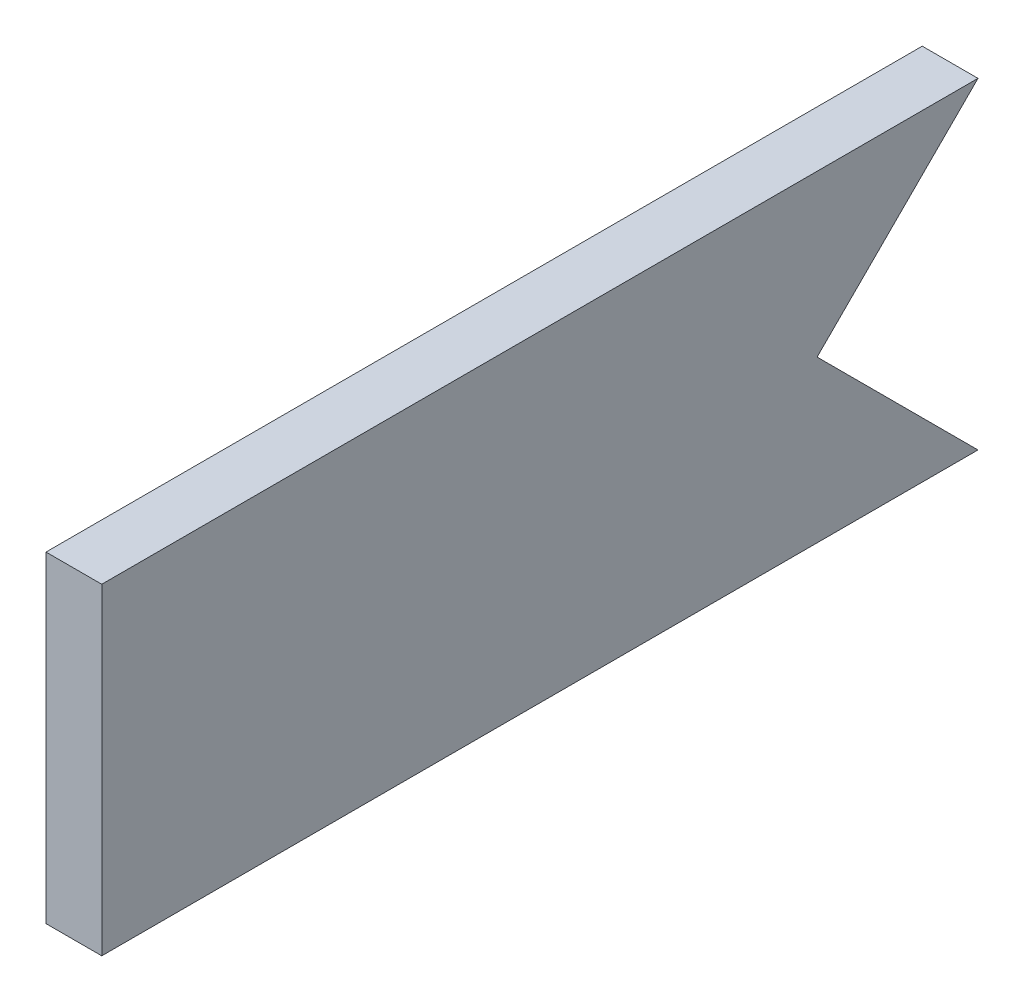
ISO-10303-21;
HEADER;
FILE_DESCRIPTION(('STEP AP214'),'2;1');
FILE_NAME('part.step','',(''),(''),'','','');
FILE_SCHEMA(('AUTOMOTIVE_DESIGN { 1 0 10303 214 1 1 1 1 }'));
ENDSEC;
DATA;
#1=APPLICATION_CONTEXT('core data for automotive mechanical design processes');
#2=APPLICATION_PROTOCOL_DEFINITION('international standard','automotive_design',2000,#1);
#3=PRODUCT_CONTEXT('',#1,'mechanical');
#4=PRODUCT('Part','Part','',(#3));
#5=PRODUCT_RELATED_PRODUCT_CATEGORY('part','',(#4));
#6=PRODUCT_DEFINITION_FORMATION('','',#4);
#7=PRODUCT_DEFINITION_CONTEXT('part definition',#1,'design');
#8=PRODUCT_DEFINITION('design','',#6,#7);
#9=PRODUCT_DEFINITION_SHAPE('','',#8);
#10=(LENGTH_UNIT() NAMED_UNIT(*) SI_UNIT(.MILLI.,.METRE.));
#11=(NAMED_UNIT(*) PLANE_ANGLE_UNIT() SI_UNIT($,.RADIAN.));
#12=(NAMED_UNIT(*) SI_UNIT($,.STERADIAN.) SOLID_ANGLE_UNIT());
#13=UNCERTAINTY_MEASURE_WITH_UNIT(LENGTH_MEASURE(1.E-05),#10,'distance_accuracy_value','');
#14=(GEOMETRIC_REPRESENTATION_CONTEXT(3) GLOBAL_UNCERTAINTY_ASSIGNED_CONTEXT((#13)) GLOBAL_UNIT_ASSIGNED_CONTEXT((#10,
#11,#12)) REPRESENTATION_CONTEXT('',''));
#15=CARTESIAN_POINT('',(0.,0.,0.));
#16=DIRECTION('',(0.,0.,1.));
#17=DIRECTION('',(1.,0.,0.));
#18=AXIS2_PLACEMENT_3D('',#15,#16,#17);
#19=CARTESIAN_POINT('',(-1.75,0.,0.));
#20=DIRECTION('',(1.,0.,0.));
#21=DIRECTION('',(0.,0.,-1.));
#22=AXIS2_PLACEMENT_3D('',#19,#20,#21);
#23=PLANE('',#22);
#24=DIRECTION('',(0.,-0.707106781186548,0.707106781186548));
#25=VECTOR('',#24,1.);
#26=CARTESIAN_POINT('',(-1.75,10.1,7.994));
#27=LINE('',#26,#25);
#28=CARTESIAN_POINT('',(-1.75,10.1,7.994));
#29=VERTEX_POINT('',#28);
#30=CARTESIAN_POINT('',(-1.75,0.,18.094));
#31=VERTEX_POINT('',#30);
#32=EDGE_CURVE('E72',#29,#31,#27,.T.);
#33=ORIENTED_EDGE('',*,*,#32,.T.);
#34=DIRECTION('',(0.,-0.707106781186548,-0.707106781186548));
#35=VECTOR('',#34,1.);
#36=CARTESIAN_POINT('',(-1.75,0.,18.094));
#37=LINE('',#36,#35);
#38=CARTESIAN_POINT('',(-1.75,-10.1,7.994));
#39=VERTEX_POINT('',#38);
#40=EDGE_CURVE('E71',#31,#39,#37,.T.);
#41=ORIENTED_EDGE('',*,*,#40,.T.);
#42=DIRECTION('',(0.,0.,-1.));
#43=VECTOR('',#42,1.);
#44=CARTESIAN_POINT('',(-1.75,-10.1,33.994));
#45=LINE('',#44,#43);
#46=CARTESIAN_POINT('',(-1.75,-10.1,62.994));
#47=VERTEX_POINT('',#46);
#48=EDGE_CURVE('E58',#47,#39,#45,.T.);
#49=ORIENTED_EDGE('',*,*,#48,.F.);
#50=DIRECTION('',(0.,1.,0.));
#51=VECTOR('',#50,1.);
#52=CARTESIAN_POINT('',(-1.75,0.,62.994));
#53=LINE('',#52,#51);
#54=CARTESIAN_POINT('',(-1.75,10.1,62.994));
#55=VERTEX_POINT('',#54);
#56=EDGE_CURVE('E62',#55,#47,#53,.F.);
#57=ORIENTED_EDGE('',*,*,#56,.F.);
#58=DIRECTION('',(0.,0.,1.));
#59=VECTOR('',#58,1.);
#60=CARTESIAN_POINT('',(-1.75,10.1,7.994));
#61=LINE('',#60,#59);
#62=EDGE_CURVE('E91',#29,#55,#61,.T.);
#63=ORIENTED_EDGE('',*,*,#62,.F.);
#64=EDGE_LOOP('',(#33,#41,#49,#57,#63));
#65=FACE_BOUND('',#64,.T.);
#66=ADVANCED_FACE('F16',(#65),#23,.F.);
#67=CARTESIAN_POINT('',(0.,-10.1,33.994));
#68=DIRECTION('',(0.,-1.,0.));
#69=DIRECTION('',(0.,0.,-1.));
#70=AXIS2_PLACEMENT_3D('',#67,#68,#69);
#71=PLANE('',#70);
#72=DIRECTION('',(0.,0.,-1.));
#73=VECTOR('',#72,1.);
#74=CARTESIAN_POINT('',(1.75,-10.1,0.));
#75=LINE('',#74,#73);
#76=CARTESIAN_POINT('',(1.75,-10.1,62.994));
#77=VERTEX_POINT('',#76);
#78=CARTESIAN_POINT('',(1.75,-10.1,7.994));
#79=VERTEX_POINT('',#78);
#80=EDGE_CURVE('E20',#77,#79,#75,.T.);
#81=ORIENTED_EDGE('',*,*,#80,.F.);
#82=DIRECTION('',(1.,0.,0.));
#83=VECTOR('',#82,1.);
#84=CARTESIAN_POINT('',(0.,-10.1,62.994));
#85=LINE('',#84,#83);
#86=EDGE_CURVE('E80',#47,#77,#85,.T.);
#87=ORIENTED_EDGE('',*,*,#86,.F.);
#88=ORIENTED_EDGE('',*,*,#48,.T.);
#89=DIRECTION('',(1.,0.,0.));
#90=VECTOR('',#89,1.);
#91=CARTESIAN_POINT('',(0.,-10.1,7.994));
#92=LINE('',#91,#90);
#93=EDGE_CURVE('E76',#39,#79,#92,.T.);
#94=ORIENTED_EDGE('',*,*,#93,.T.);
#95=EDGE_LOOP('',(#81,#87,#88,#94));
#96=FACE_BOUND('',#95,.T.);
#97=ADVANCED_FACE('F78',(#96),#71,.T.);
#98=CARTESIAN_POINT('',(0.,0.,18.094));
#99=DIRECTION('',(0.,-0.707106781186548,0.707106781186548));
#100=DIRECTION('',(0.,-0.707106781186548,-0.707106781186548));
#101=AXIS2_PLACEMENT_3D('',#98,#99,#100);
#102=PLANE('',#101);
#103=ORIENTED_EDGE('',*,*,#40,.F.);
#104=DIRECTION('',(1.,0.,0.));
#105=VECTOR('',#104,1.);
#106=CARTESIAN_POINT('',(0.,0.,18.094));
#107=LINE('',#106,#105);
#108=CARTESIAN_POINT('',(1.75,0.,18.094));
#109=VERTEX_POINT('',#108);
#110=EDGE_CURVE('E86',#31,#109,#107,.T.);
#111=ORIENTED_EDGE('',*,*,#110,.T.);
#112=DIRECTION('',(0.,0.707106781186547,0.707106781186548));
#113=VECTOR('',#112,1.);
#114=CARTESIAN_POINT('',(1.75,-10.1,7.994));
#115=LINE('',#114,#113);
#116=EDGE_CURVE('E84',#79,#109,#115,.T.);
#117=ORIENTED_EDGE('',*,*,#116,.F.);
#118=ORIENTED_EDGE('',*,*,#93,.F.);
#119=EDGE_LOOP('',(#103,#111,#117,#118));
#120=FACE_BOUND('',#119,.T.);
#121=ADVANCED_FACE('F82',(#120),#102,.F.);
#122=CARTESIAN_POINT('',(0.,10.1,7.994));
#123=DIRECTION('',(0.,0.707106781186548,0.707106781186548));
#124=DIRECTION('',(0.,-0.707106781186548,0.707106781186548));
#125=AXIS2_PLACEMENT_3D('',#122,#123,#124);
#126=PLANE('',#125);
#127=ORIENTED_EDGE('',*,*,#32,.F.);
#128=DIRECTION('',(1.,0.,0.));
#129=VECTOR('',#128,1.);
#130=CARTESIAN_POINT('',(0.,10.1,7.994));
#131=LINE('',#130,#129);
#132=CARTESIAN_POINT('',(1.75,10.1,7.994));
#133=VERTEX_POINT('',#132);
#134=EDGE_CURVE('E89',#133,#29,#131,.F.);
#135=ORIENTED_EDGE('',*,*,#134,.F.);
#136=DIRECTION('',(0.,0.707106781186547,-0.707106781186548));
#137=VECTOR('',#136,1.);
#138=CARTESIAN_POINT('',(1.75,0.,18.094));
#139=LINE('',#138,#137);
#140=EDGE_CURVE('E100',#109,#133,#139,.T.);
#141=ORIENTED_EDGE('',*,*,#140,.F.);
#142=ORIENTED_EDGE('',*,*,#110,.F.);
#143=EDGE_LOOP('',(#127,#135,#141,#142));
#144=FACE_BOUND('',#143,.T.);
#145=ADVANCED_FACE('F112',(#144),#126,.F.);
#146=CARTESIAN_POINT('',(0.,10.1,7.994));
#147=DIRECTION('',(0.,1.,0.));
#148=DIRECTION('',(0.,0.,1.));
#149=AXIS2_PLACEMENT_3D('',#146,#147,#148);
#150=PLANE('',#149);
#151=ORIENTED_EDGE('',*,*,#62,.T.);
#152=DIRECTION('',(1.,0.,0.));
#153=VECTOR('',#152,1.);
#154=CARTESIAN_POINT('',(0.,10.1,62.994));
#155=LINE('',#154,#153);
#156=CARTESIAN_POINT('',(1.75,10.1,62.994));
#157=VERTEX_POINT('',#156);
#158=EDGE_CURVE('E35',#157,#55,#155,.F.);
#159=ORIENTED_EDGE('',*,*,#158,.F.);
#160=DIRECTION('',(0.,0.,-1.));
#161=VECTOR('',#160,1.);
#162=CARTESIAN_POINT('',(1.75,10.1,0.));
#163=LINE('',#162,#161);
#164=EDGE_CURVE('E26',#133,#157,#163,.F.);
#165=ORIENTED_EDGE('',*,*,#164,.F.);
#166=ORIENTED_EDGE('',*,*,#134,.T.);
#167=EDGE_LOOP('',(#151,#159,#165,#166));
#168=FACE_BOUND('',#167,.T.);
#169=ADVANCED_FACE('F106',(#168),#150,.T.);
#170=CARTESIAN_POINT('',(0.,0.,62.994));
#171=DIRECTION('',(0.,0.,1.));
#172=DIRECTION('',(1.,0.,0.));
#173=AXIS2_PLACEMENT_3D('',#170,#171,#172);
#174=PLANE('',#173);
#175=DIRECTION('',(0.,1.,0.));
#176=VECTOR('',#175,1.);
#177=CARTESIAN_POINT('',(1.75,0.,62.994));
#178=LINE('',#177,#176);
#179=EDGE_CURVE('E11',#157,#77,#178,.F.);
#180=ORIENTED_EDGE('',*,*,#179,.F.);
#181=ORIENTED_EDGE('',*,*,#158,.T.);
#182=ORIENTED_EDGE('',*,*,#56,.T.);
#183=ORIENTED_EDGE('',*,*,#86,.T.);
#184=EDGE_LOOP('',(#180,#181,#182,#183));
#185=FACE_BOUND('',#184,.T.);
#186=ADVANCED_FACE('F104',(#185),#174,.T.);
#187=CARTESIAN_POINT('',(1.75,0.,0.));
#188=DIRECTION('',(1.,0.,0.));
#189=DIRECTION('',(0.,0.,-1.));
#190=AXIS2_PLACEMENT_3D('',#187,#188,#189);
#191=PLANE('',#190);
#192=ORIENTED_EDGE('',*,*,#164,.T.);
#193=ORIENTED_EDGE('',*,*,#179,.T.);
#194=ORIENTED_EDGE('',*,*,#80,.T.);
#195=ORIENTED_EDGE('',*,*,#116,.T.);
#196=ORIENTED_EDGE('',*,*,#140,.T.);
#197=EDGE_LOOP('',(#192,#193,#194,#195,#196));
#198=FACE_BOUND('',#197,.T.);
#199=ADVANCED_FACE('F18',(#198),#191,.T.);
#200=CLOSED_SHELL('',(#66,#97,#121,#145,#169,#186,#199));
#201=MANIFOLD_SOLID_BREP('B1',#200);
#202=ADVANCED_BREP_SHAPE_REPRESENTATION('',(#18,#201),#14);
#203=SHAPE_DEFINITION_REPRESENTATION(#9,#202);
ENDSEC;
END-ISO-10303-21;
